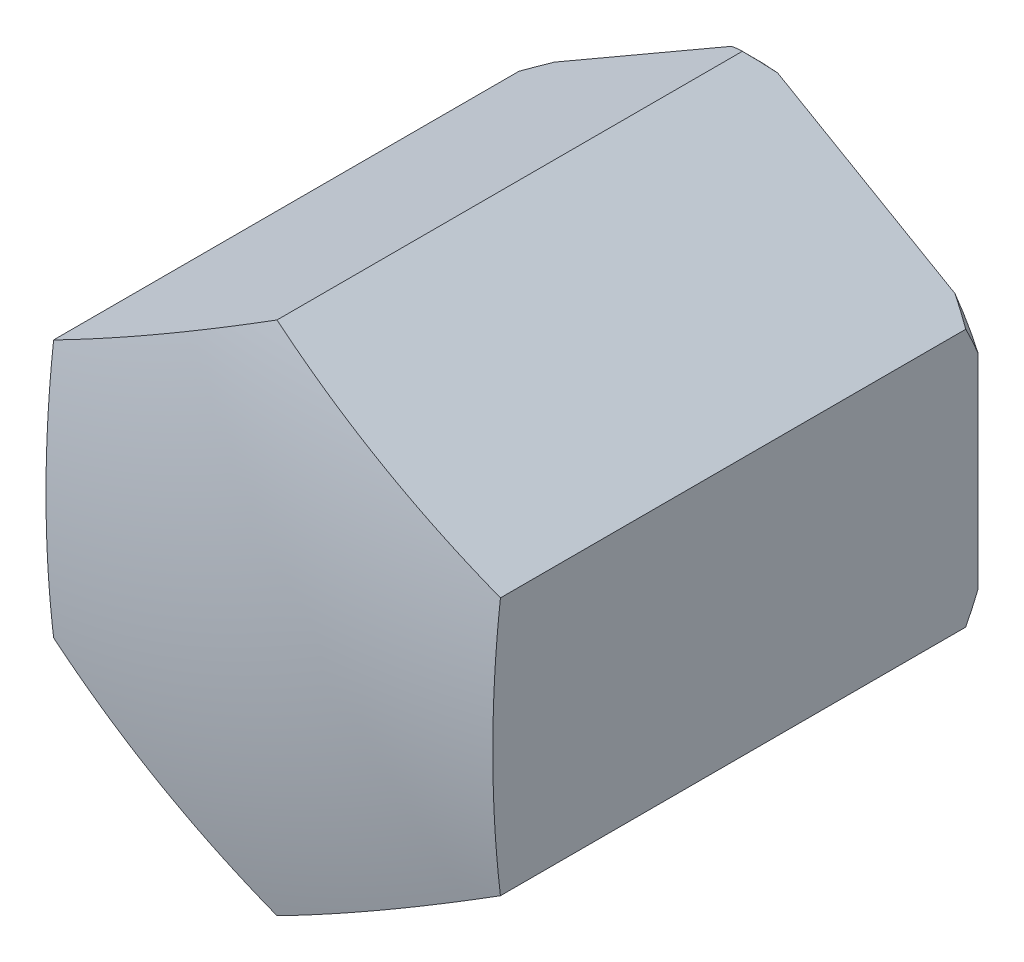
ISO-10303-21;
HEADER;
FILE_DESCRIPTION(('STEP AP214'),'2;1');
FILE_NAME('part.step','',(''),(''),'','','');
FILE_SCHEMA(('AUTOMOTIVE_DESIGN { 1 0 10303 214 1 1 1 1 }'));
ENDSEC;
DATA;
#1=APPLICATION_CONTEXT('core data for automotive mechanical design processes');
#2=APPLICATION_PROTOCOL_DEFINITION('international standard','automotive_design',2000,#1);
#3=PRODUCT_CONTEXT('',#1,'mechanical');
#4=PRODUCT('Part','Part','',(#3));
#5=PRODUCT_RELATED_PRODUCT_CATEGORY('part','',(#4));
#6=PRODUCT_DEFINITION_FORMATION('','',#4);
#7=PRODUCT_DEFINITION_CONTEXT('part definition',#1,'design');
#8=PRODUCT_DEFINITION('design','',#6,#7);
#9=PRODUCT_DEFINITION_SHAPE('','',#8);
#10=(LENGTH_UNIT() NAMED_UNIT(*) SI_UNIT(.MILLI.,.METRE.));
#11=(NAMED_UNIT(*) PLANE_ANGLE_UNIT() SI_UNIT($,.RADIAN.));
#12=(NAMED_UNIT(*) SI_UNIT($,.STERADIAN.) SOLID_ANGLE_UNIT());
#13=UNCERTAINTY_MEASURE_WITH_UNIT(LENGTH_MEASURE(1.E-05),#10,'distance_accuracy_value','');
#14=(GEOMETRIC_REPRESENTATION_CONTEXT(3) GLOBAL_UNCERTAINTY_ASSIGNED_CONTEXT((#13)) GLOBAL_UNIT_ASSIGNED_CONTEXT((#10,
#11,#12)) REPRESENTATION_CONTEXT('',''));
#15=CARTESIAN_POINT('',(0.,0.,0.));
#16=DIRECTION('',(0.,0.,1.));
#17=DIRECTION('',(1.,0.,0.));
#18=AXIS2_PLACEMENT_3D('',#15,#16,#17);
#19=CARTESIAN_POINT('',(0.,12.701705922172,26.));
#20=DIRECTION('',(0.500000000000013,-0.866025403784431,0.));
#21=DIRECTION('',(0.866025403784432,0.500000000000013,0.));
#22=AXIS2_PLACEMENT_3D('',#19,#20,#21);
#23=PLANE('',#22);
#24=CARTESIAN_POINT('',(-5.5000000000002,9.52627944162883,-30.));
#25=DIRECTION('',(0.500000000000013,-0.866025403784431,0.));
#26=DIRECTION('',(0.866025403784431,0.500000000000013,0.));
#27=AXIS2_PLACEMENT_3D('',#24,#25,#26);
#28=CIRCLE('',#27,53.8887743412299);
#29=CARTESIAN_POINT('',(0.,12.701705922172,23.5132382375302));
#30=VERTEX_POINT('',#29);
#31=CARTESIAN_POINT('',(-11.,6.3508529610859,23.5132382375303));
#32=VERTEX_POINT('',#31);
#33=EDGE_CURVE('E105',#30,#32,#28,.T.);
#34=ORIENTED_EDGE('',*,*,#33,.F.);
#35=DIRECTION('',(0.,0.,-1.));
#36=VECTOR('',#35,1.);
#37=CARTESIAN_POINT('',(0.,12.701705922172,26.));
#38=LINE('',#37,#36);
#39=CARTESIAN_POINT('',(0.,12.701705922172,0.601705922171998));
#40=VERTEX_POINT('',#39);
#41=EDGE_CURVE('E111',#30,#40,#38,.T.);
#42=ORIENTED_EDGE('',*,*,#41,.T.);
#43=CARTESIAN_POINT('',(0.000200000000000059,12.7018213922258,0.601821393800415));
#44=CARTESIAN_POINT('',(-0.0929349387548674,12.6480499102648,0.548049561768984));
#45=CARTESIAN_POINT('',(-0.186425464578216,12.594073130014,0.495094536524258));
#46=CARTESIAN_POINT('',(-0.374109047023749,12.4857139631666,0.390955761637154));
#47=CARTESIAN_POINT('',(-0.468301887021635,12.431331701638,0.339771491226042));
#48=CARTESIAN_POINT('',(-0.6574388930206,12.3221334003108,0.239278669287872));
#49=CARTESIAN_POINT('',(-0.752383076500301,12.2673173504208,0.189970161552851));
#50=CARTESIAN_POINT('',(-0.943063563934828,12.1572279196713,0.0933496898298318));
#51=CARTESIAN_POINT('',(-1.0388000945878,12.1019544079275,0.0460383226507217));
#52=CARTESIAN_POINT('',(-1.13492611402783,12.0464560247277,-0.000199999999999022));
#53=B_SPLINE_CURVE_WITH_KNOTS('',3,(#43,#44,#45,#46,#47,#48,#49,#50,#51,#52),.UNSPECIFIED.,.F.,
.F.,(4,2,2,2,4),(0.,0.360709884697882,0.721312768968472,1.08192406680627,1.44264237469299),.UNSPECIFIED.);
#54=CARTESIAN_POINT('',(-1.13451033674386,12.0466960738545,0.));
#55=VERTEX_POINT('',#54);
#56=EDGE_CURVE('E217',#40,#55,#53,.T.);
#57=ORIENTED_EDGE('',*,*,#56,.T.);
#58=DIRECTION('',(-0.866025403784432,-0.500000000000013,0.));
#59=VECTOR('',#58,1.);
#60=CARTESIAN_POINT('',(3.57499999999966,14.7657331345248,0.));
#61=LINE('',#60,#59);
#62=CARTESIAN_POINT('',(-9.86548966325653,7.00586280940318,0.));
#63=VERTEX_POINT('',#62);
#64=EDGE_CURVE('E23',#55,#63,#61,.T.);
#65=ORIENTED_EDGE('',*,*,#64,.T.);
#66=CARTESIAN_POINT('',(-9.86507388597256,7.00610285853,-0.00019999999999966));
#67=CARTESIAN_POINT('',(-9.96119990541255,6.95060447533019,0.0460383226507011));
#68=CARTESIAN_POINT('',(-10.0569364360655,6.89533096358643,0.0933496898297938));
#69=CARTESIAN_POINT('',(-10.2476169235,6.78524153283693,0.189970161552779));
#70=CARTESIAN_POINT('',(-10.3425611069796,6.73042548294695,0.239278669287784));
#71=CARTESIAN_POINT('',(-10.5316981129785,6.62122718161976,0.339771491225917));
#72=CARTESIAN_POINT('',(-10.6258909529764,6.56684492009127,0.390955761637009));
#73=CARTESIAN_POINT('',(-10.8135745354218,6.4584857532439,0.495094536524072));
#74=CARTESIAN_POINT('',(-10.9070650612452,6.40450897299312,0.548049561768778));
#75=CARTESIAN_POINT('',(-11.0002,6.35073749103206,0.601821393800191));
#76=B_SPLINE_CURVE_WITH_KNOTS('',3,(#66,#67,#68,#69,#70,#71,#72,#73,#74,#75),.UNSPECIFIED.,.F.,
.F.,(4,2,2,2,4),(0.,0.360718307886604,0.721329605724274,1.08193248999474,1.4426423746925),.UNSPECIFIED.);
#77=CARTESIAN_POINT('',(-11.,6.3508529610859,0.601705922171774));
#78=VERTEX_POINT('',#77);
#79=EDGE_CURVE('E223',#63,#78,#76,.T.);
#80=ORIENTED_EDGE('',*,*,#79,.T.);
#81=DIRECTION('',(0.,0.,-1.));
#82=VECTOR('',#81,1.);
#83=CARTESIAN_POINT('',(-11.,6.3508529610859,26.));
#84=LINE('',#83,#82);
#85=EDGE_CURVE('E114',#32,#78,#84,.T.);
#86=ORIENTED_EDGE('',*,*,#85,.F.);
#87=EDGE_LOOP('',(#34,#42,#57,#65,#80,#86));
#88=FACE_BOUND('',#87,.T.);
#89=ADVANCED_FACE('F14',(#88),#23,.F.);
#90=CARTESIAN_POINT('',(-11.,6.3508529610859,26.));
#91=DIRECTION('',(1.,0.,0.));
#92=DIRECTION('',(0.,1.,0.));
#93=AXIS2_PLACEMENT_3D('',#90,#91,#92);
#94=PLANE('',#93);
#95=CARTESIAN_POINT('',(-11.,0.,-30.));
#96=DIRECTION('',(1.,0.,0.));
#97=DIRECTION('',(0.,0.,-1.));
#98=AXIS2_PLACEMENT_3D('',#95,#96,#97);
#99=CIRCLE('',#98,53.8887743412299);
#100=CARTESIAN_POINT('',(-11.,-6.3508529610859,23.5132382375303));
#101=VERTEX_POINT('',#100);
#102=EDGE_CURVE('E116',#32,#101,#99,.T.);
#103=ORIENTED_EDGE('',*,*,#102,.F.);
#104=ORIENTED_EDGE('',*,*,#85,.T.);
#105=CARTESIAN_POINT('',(-11.,16.0724477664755,7.37623108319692));
#106=CARTESIAN_POINT('',(-11.,15.8702057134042,7.2093371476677));
#107=CARTESIAN_POINT('',(-11.,15.6674737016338,7.04303709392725));
#108=CARTESIAN_POINT('',(-11.,15.2609313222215,6.71175492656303));
#109=CARTESIAN_POINT('',(-11.,15.0571209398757,6.54677283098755));
#110=CARTESIAN_POINT('',(-11.,14.4438351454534,6.05392702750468));
#111=CARTESIAN_POINT('',(-11.,14.0326017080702,5.72824373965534));
#112=CARTESIAN_POINT('',(-11.,13.1999564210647,5.08050106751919));
#113=CARTESIAN_POINT('',(-11.,12.7784823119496,4.75852150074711));
#114=CARTESIAN_POINT('',(-11.,11.9286566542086,4.12384110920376));
#115=CARTESIAN_POINT('',(-11.,11.5003057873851,3.81113937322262));
#116=CARTESIAN_POINT('',(-11.,10.5931500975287,3.16769731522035));
#117=CARTESIAN_POINT('',(-11.,10.1134868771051,2.83815635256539));
#118=CARTESIAN_POINT('',(-11.,9.38449294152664,2.35805816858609));
#119=CARTESIAN_POINT('',(-11.,9.13985858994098,2.20036220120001));
#120=CARTESIAN_POINT('',(-11.,8.64708986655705,1.89054685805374));
#121=CARTESIAN_POINT('',(-11.,8.39895566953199,1.73842720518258));
#122=CARTESIAN_POINT('',(-11.,7.89995903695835,1.441394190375));
#123=CARTESIAN_POINT('',(-11.,7.64911460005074,1.29645066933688));
#124=CARTESIAN_POINT('',(-11.,7.14316420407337,1.01414178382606));
#125=CARTESIAN_POINT('',(-11.,6.8880580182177,0.876776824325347));
#126=CARTESIAN_POINT('',(-11.,6.37340355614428,0.611087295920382));
#127=CARTESIAN_POINT('',(-11.,6.11385871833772,0.482756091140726));
#128=CARTESIAN_POINT('',(-11.,5.58983912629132,0.236644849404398));
#129=CARTESIAN_POINT('',(-11.,5.32536528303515,0.118862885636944));
#130=CARTESIAN_POINT('',(-11.,4.87055760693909,-0.0711489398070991));
#131=CARTESIAN_POINT('',(-11.,4.68153595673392,-0.146517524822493));
#132=CARTESIAN_POINT('',(-11.,4.30090682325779,-0.290396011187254));
#133=CARTESIAN_POINT('',(-11.,4.10929935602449,-0.35890595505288));
#134=CARTESIAN_POINT('',(-11.,3.53054922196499,-0.55302199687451));
#135=CARTESIAN_POINT('',(-11.,3.13947003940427,-0.667218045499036));
#136=CARTESIAN_POINT('',(-11.,2.3571577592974,-0.856520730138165));
#137=CARTESIAN_POINT('',(-11.,1.96613010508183,-0.932456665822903));
#138=CARTESIAN_POINT('',(-11.,1.3754168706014,-1.01606525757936));
#139=CARTESIAN_POINT('',(-11.,1.17780635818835,-1.03888598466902));
#140=CARTESIAN_POINT('',(-11.,0.781637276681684,-1.0740268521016));
#141=CARTESIAN_POINT('',(-11.,0.583078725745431,-1.0863471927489));
#142=CARTESIAN_POINT('',(-11.,0.196510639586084,-1.09984708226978));
#143=CARTESIAN_POINT('',(-11.,0.00852086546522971,-1.10160151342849));
#144=CARTESIAN_POINT('',(-11.,-0.367323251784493,-1.09547279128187));
#145=CARTESIAN_POINT('',(-11.,-0.555177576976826,-1.08758853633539));
#146=CARTESIAN_POINT('',(-11.,-0.930229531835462,-1.06232225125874));
#147=CARTESIAN_POINT('',(-11.,-1.11742721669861,-1.04494103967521));
#148=CARTESIAN_POINT('',(-11.,-1.49075054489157,-1.00099406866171));
#149=CARTESIAN_POINT('',(-11.,-1.67687603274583,-0.974427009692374));
#150=CARTESIAN_POINT('',(-11.,-2.24018324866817,-0.880381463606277));
#151=CARTESIAN_POINT('',(-11.,-2.61511811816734,-0.799063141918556));
#152=CARTESIAN_POINT('',(-11.,-3.35650285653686,-0.604878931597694));
#153=CARTESIAN_POINT('',(-11.,-3.72295280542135,-0.492013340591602));
#154=CARTESIAN_POINT('',(-11.,-4.4529629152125,-0.237887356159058));
#155=CARTESIAN_POINT('',(-11.,-4.81636046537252,-0.0961649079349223));
#156=CARTESIAN_POINT('',(-11.,-5.53386860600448,0.20927334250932));
#157=CARTESIAN_POINT('',(-11.,-5.88797506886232,0.372998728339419));
#158=CARTESIAN_POINT('',(-11.,-6.5885282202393,0.718563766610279));
#159=CARTESIAN_POINT('',(-11.,-6.93494780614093,0.900457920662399));
#160=CARTESIAN_POINT('',(-11.,-7.61987412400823,1.27837528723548));
#161=CARTESIAN_POINT('',(-11.,-7.95838202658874,1.47439639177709));
#162=CARTESIAN_POINT('',(-11.,-8.61194162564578,1.86785203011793));
#163=CARTESIAN_POINT('',(-11.,-8.92732558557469,2.06473756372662));
#164=CARTESIAN_POINT('',(-11.,-9.55267412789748,2.46695903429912));
#165=CARTESIAN_POINT('',(-11.,-9.86263830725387,2.67229559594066));
#166=CARTESIAN_POINT('',(-11.,-10.4753887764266,3.08826754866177));
#167=CARTESIAN_POINT('',(-11.,-10.7782124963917,3.29884800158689));
#168=CARTESIAN_POINT('',(-11.,-11.3796956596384,3.72570793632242));
#169=CARTESIAN_POINT('',(-11.,-11.6783562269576,3.94198583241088));
#170=CARTESIAN_POINT('',(-11.,-11.9752680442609,4.16059792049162));
#171=B_SPLINE_CURVE_WITH_KNOTS('',3,(#105,#106,#107,#108,#109,#110,#111,#112,#113,#114,#115,
#116,#117,#118,#119,#120,#121,#122,#123,#124,#125,#126,#127,#128,#129,#130,#131,#132,#133,#134,
#135,#136,#137,#138,#139,#140,#141,#142,#143,#144,#145,#146,#147,#148,#149,#150,#151,#152,#153,
#154,#155,#156,#157,#158,#159,#160,#161,#162,#163,#164,#165,#166,#167,#168,#169,#170),
.UNSPECIFIED.,.F.,.F.,(4,2,2,2,2,2,2,2,2,2,2,2,2,2,2,2,2,2,2,2,2,2,2,2,2,2,2,2,2,2,2,2,4),(0.,
0.7866358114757,1.57328237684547,3.14695168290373,4.73801099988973,6.32891353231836,
8.0743905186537,8.94750152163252,9.82056907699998,10.6895860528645,11.5586494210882,
12.4270675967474,13.2953268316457,13.9056838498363,14.5160370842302,15.7367149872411,
16.9296541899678,17.5261883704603,18.1227111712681,18.6864613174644,19.2502759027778,
19.8140419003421,20.3778876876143,21.5270730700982,22.6762476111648,23.845519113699,
25.0153015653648,26.1887049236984,27.3619335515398,28.4771587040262,29.5924664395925,
30.698929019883,31.8050868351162),.UNSPECIFIED.);
#172=CARTESIAN_POINT('',(-11.,5.04083326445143,0.));
#173=VERTEX_POINT('',#172);
#174=EDGE_CURVE('E216',#78,#173,#171,.T.);
#175=ORIENTED_EDGE('',*,*,#174,.T.);
#176=DIRECTION('',(0.,-1.,0.));
#177=VECTOR('',#176,1.);
#178=CARTESIAN_POINT('',(-11.,0.,0.));
#179=LINE('',#178,#177);
#180=CARTESIAN_POINT('',(-11.,-5.04083326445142,0.));
#181=VERTEX_POINT('',#180);
#182=EDGE_CURVE('E242',#173,#181,#179,.T.);
#183=ORIENTED_EDGE('',*,*,#182,.T.);
#184=CARTESIAN_POINT('',(-11.,-6.3508529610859,0.601705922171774));
#185=VERTEX_POINT('',#184);
#186=EDGE_CURVE('E209',#181,#185,#171,.T.);
#187=ORIENTED_EDGE('',*,*,#186,.T.);
#188=DIRECTION('',(0.,0.,-1.));
#189=VECTOR('',#188,1.);
#190=CARTESIAN_POINT('',(-11.,-6.3508529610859,26.));
#191=LINE('',#190,#189);
#192=EDGE_CURVE('E134',#101,#185,#191,.T.);
#193=ORIENTED_EDGE('',*,*,#192,.F.);
#194=EDGE_LOOP('',(#103,#104,#175,#183,#187,#193));
#195=FACE_BOUND('',#194,.T.);
#196=ADVANCED_FACE('F201',(#195),#94,.F.);
#197=CARTESIAN_POINT('',(-11.,-6.3508529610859,26.));
#198=DIRECTION('',(0.500000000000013,0.866025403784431,0.));
#199=DIRECTION('',(-0.866025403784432,0.500000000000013,0.));
#200=AXIS2_PLACEMENT_3D('',#197,#198,#199);
#201=PLANE('',#200);
#202=CARTESIAN_POINT('',(-5.5000000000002,-9.52627944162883,-30.));
#203=DIRECTION('',(0.500000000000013,0.866025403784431,0.));
#204=DIRECTION('',(-0.866025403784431,0.500000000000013,0.));
#205=AXIS2_PLACEMENT_3D('',#202,#203,#204);
#206=CIRCLE('',#205,53.8887743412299);
#207=CARTESIAN_POINT('',(0.,-12.701705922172,23.5132382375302));
#208=VERTEX_POINT('',#207);
#209=EDGE_CURVE('E289',#101,#208,#206,.T.);
#210=ORIENTED_EDGE('',*,*,#209,.F.);
#211=ORIENTED_EDGE('',*,*,#192,.T.);
#212=CARTESIAN_POINT('',(-11.0002,-6.35073749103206,0.601821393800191));
#213=CARTESIAN_POINT('',(-10.9070650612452,-6.40450897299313,0.548049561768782));
#214=CARTESIAN_POINT('',(-10.8135745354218,-6.4584857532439,0.495094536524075));
#215=CARTESIAN_POINT('',(-10.6258909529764,-6.56684492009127,0.390955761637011));
#216=CARTESIAN_POINT('',(-10.5316981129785,-6.62122718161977,0.339771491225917));
#217=CARTESIAN_POINT('',(-10.3425611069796,-6.73042548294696,0.239278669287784));
#218=CARTESIAN_POINT('',(-10.2476169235,-6.78524153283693,0.189970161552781));
#219=CARTESIAN_POINT('',(-10.0569364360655,-6.89533096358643,0.0933496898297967));
#220=CARTESIAN_POINT('',(-9.96119990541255,-6.95060447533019,0.0460383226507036));
#221=CARTESIAN_POINT('',(-9.86507388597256,-7.00610285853,-0.000200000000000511));
#222=B_SPLINE_CURVE_WITH_KNOTS('',3,(#212,#213,#214,#215,#216,#217,#218,#219,#220,#221),
.UNSPECIFIED.,.F.,.F.,(4,2,2,2,4),(0.,0.360709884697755,0.721312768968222,1.08192406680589,
1.4426423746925),.UNSPECIFIED.);
#223=CARTESIAN_POINT('',(-9.86548966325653,-7.00586280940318,0.));
#224=VERTEX_POINT('',#223);
#225=EDGE_CURVE('E185',#185,#224,#222,.T.);
#226=ORIENTED_EDGE('',*,*,#225,.T.);
#227=DIRECTION('',(0.866025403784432,-0.500000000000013,0.));
#228=VECTOR('',#227,1.);
#229=CARTESIAN_POINT('',(3.57499999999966,-14.7657331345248,0.));
#230=LINE('',#229,#228);
#231=CARTESIAN_POINT('',(-1.13451033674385,-12.0466960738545,0.));
#232=VERTEX_POINT('',#231);
#233=EDGE_CURVE('E240',#224,#232,#230,.T.);
#234=ORIENTED_EDGE('',*,*,#233,.T.);
#235=CARTESIAN_POINT('',(-1.13492611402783,-12.0464560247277,-0.00019999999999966));
#236=CARTESIAN_POINT('',(-1.0388000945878,-12.1019544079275,0.0460383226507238));
#237=CARTESIAN_POINT('',(-0.94306356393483,-12.1572279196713,0.0933496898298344));
#238=CARTESIAN_POINT('',(-0.752383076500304,-12.2673173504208,0.189970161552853));
#239=CARTESIAN_POINT('',(-0.657438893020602,-12.3221334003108,0.239278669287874));
#240=CARTESIAN_POINT('',(-0.468301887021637,-12.431331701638,0.339771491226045));
#241=CARTESIAN_POINT('',(-0.374109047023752,-12.4857139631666,0.390955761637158));
#242=CARTESIAN_POINT('',(-0.186425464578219,-12.594073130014,0.495094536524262));
#243=CARTESIAN_POINT('',(-0.0929349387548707,-12.6480499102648,0.548049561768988));
#244=CARTESIAN_POINT('',(0.000199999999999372,-12.7018213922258,0.601821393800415));
#245=B_SPLINE_CURVE_WITH_KNOTS('',3,(#235,#236,#237,#238,#239,#240,#241,#242,#243,#244),
.UNSPECIFIED.,.F.,.F.,(4,2,2,2,4),(0.,0.360718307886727,0.721329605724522,1.08193248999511,
1.44264237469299),.UNSPECIFIED.);
#246=CARTESIAN_POINT('',(0.,-12.701705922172,0.601705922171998));
#247=VERTEX_POINT('',#246);
#248=EDGE_CURVE('E191',#232,#247,#245,.T.);
#249=ORIENTED_EDGE('',*,*,#248,.T.);
#250=DIRECTION('',(0.,0.,-1.));
#251=VECTOR('',#250,1.);
#252=CARTESIAN_POINT('',(0.,-12.701705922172,26.));
#253=LINE('',#252,#251);
#254=EDGE_CURVE('E132',#208,#247,#253,.T.);
#255=ORIENTED_EDGE('',*,*,#254,.F.);
#256=EDGE_LOOP('',(#210,#211,#226,#234,#249,#255));
#257=FACE_BOUND('',#256,.T.);
#258=ADVANCED_FACE('F197',(#257),#201,.F.);
#259=CARTESIAN_POINT('',(0.,-12.701705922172,26.));
#260=DIRECTION('',(-0.500000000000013,0.866025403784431,0.));
#261=DIRECTION('',(-0.866025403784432,-0.500000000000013,0.));
#262=AXIS2_PLACEMENT_3D('',#259,#260,#261);
#263=PLANE('',#262);
#264=CARTESIAN_POINT('',(5.5000000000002,-9.52627944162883,-30.));
#265=DIRECTION('',(-0.500000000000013,0.866025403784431,0.));
#266=DIRECTION('',(-0.866025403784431,-0.500000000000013,0.));
#267=AXIS2_PLACEMENT_3D('',#264,#265,#266);
#268=CIRCLE('',#267,53.8887743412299);
#269=CARTESIAN_POINT('',(11.,-6.3508529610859,23.5132382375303));
#270=VERTEX_POINT('',#269);
#271=EDGE_CURVE('E291',#208,#270,#268,.T.);
#272=ORIENTED_EDGE('',*,*,#271,.F.);
#273=ORIENTED_EDGE('',*,*,#254,.T.);
#274=CARTESIAN_POINT('',(-0.000200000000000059,-12.7018213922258,0.601821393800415));
#275=CARTESIAN_POINT('',(0.0929349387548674,-12.6480499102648,0.548049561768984));
#276=CARTESIAN_POINT('',(0.186425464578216,-12.594073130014,0.495094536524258));
#277=CARTESIAN_POINT('',(0.374109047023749,-12.4857139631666,0.390955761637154));
#278=CARTESIAN_POINT('',(0.468301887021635,-12.431331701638,0.339771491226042));
#279=CARTESIAN_POINT('',(0.6574388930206,-12.3221334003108,0.239278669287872));
#280=CARTESIAN_POINT('',(0.752383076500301,-12.2673173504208,0.189970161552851));
#281=CARTESIAN_POINT('',(0.943063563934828,-12.1572279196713,0.0933496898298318));
#282=CARTESIAN_POINT('',(1.0388000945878,-12.1019544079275,0.0460383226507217));
#283=CARTESIAN_POINT('',(1.13492611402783,-12.0464560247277,-0.000199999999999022));
#284=B_SPLINE_CURVE_WITH_KNOTS('',3,(#274,#275,#276,#277,#278,#279,#280,#281,#282,#283),
.UNSPECIFIED.,.F.,.F.,(4,2,2,2,4),(0.,0.360709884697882,0.721312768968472,1.08192406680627,
1.44264237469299),.UNSPECIFIED.);
#285=CARTESIAN_POINT('',(1.13451033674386,-12.0466960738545,0.));
#286=VERTEX_POINT('',#285);
#287=EDGE_CURVE('E172',#247,#286,#284,.T.);
#288=ORIENTED_EDGE('',*,*,#287,.T.);
#289=DIRECTION('',(0.866025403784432,0.500000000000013,0.));
#290=VECTOR('',#289,1.);
#291=CARTESIAN_POINT('',(14.575,-4.28682574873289,0.));
#292=LINE('',#291,#290);
#293=CARTESIAN_POINT('',(9.86548966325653,-7.00586280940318,0.));
#294=VERTEX_POINT('',#293);
#295=EDGE_CURVE('E238',#286,#294,#292,.T.);
#296=ORIENTED_EDGE('',*,*,#295,.T.);
#297=CARTESIAN_POINT('',(9.86507388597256,-7.00610285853,-0.00019999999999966));
#298=CARTESIAN_POINT('',(9.96119990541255,-6.95060447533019,0.0460383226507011));
#299=CARTESIAN_POINT('',(10.0569364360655,-6.89533096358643,0.0933496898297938));
#300=CARTESIAN_POINT('',(10.2476169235,-6.78524153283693,0.189970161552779));
#301=CARTESIAN_POINT('',(10.3425611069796,-6.73042548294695,0.239278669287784));
#302=CARTESIAN_POINT('',(10.5316981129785,-6.62122718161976,0.339771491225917));
#303=CARTESIAN_POINT('',(10.6258909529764,-6.56684492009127,0.390955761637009));
#304=CARTESIAN_POINT('',(10.8135745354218,-6.4584857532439,0.495094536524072));
#305=CARTESIAN_POINT('',(10.9070650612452,-6.40450897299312,0.548049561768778));
#306=CARTESIAN_POINT('',(11.0002,-6.35073749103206,0.601821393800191));
#307=B_SPLINE_CURVE_WITH_KNOTS('',3,(#297,#298,#299,#300,#301,#302,#303,#304,#305,#306),
.UNSPECIFIED.,.F.,.F.,(4,2,2,2,4),(0.,0.360718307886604,0.721329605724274,1.08193248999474,
1.4426423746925),.UNSPECIFIED.);
#308=CARTESIAN_POINT('',(11.,-6.3508529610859,0.601705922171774));
#309=VERTEX_POINT('',#308);
#310=EDGE_CURVE('E178',#294,#309,#307,.T.);
#311=ORIENTED_EDGE('',*,*,#310,.T.);
#312=DIRECTION('',(0.,0.,-1.));
#313=VECTOR('',#312,1.);
#314=CARTESIAN_POINT('',(11.,-6.3508529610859,26.));
#315=LINE('',#314,#313);
#316=EDGE_CURVE('E125',#270,#309,#315,.T.);
#317=ORIENTED_EDGE('',*,*,#316,.F.);
#318=EDGE_LOOP('',(#272,#273,#288,#296,#311,#317));
#319=FACE_BOUND('',#318,.T.);
#320=ADVANCED_FACE('F160',(#319),#263,.F.);
#321=CARTESIAN_POINT('',(11.,-6.3508529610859,26.));
#322=DIRECTION('',(-1.,0.,0.));
#323=DIRECTION('',(0.,-1.,0.));
#324=AXIS2_PLACEMENT_3D('',#321,#322,#323);
#325=PLANE('',#324);
#326=CARTESIAN_POINT('',(11.,0.,-30.));
#327=DIRECTION('',(-1.,0.,0.));
#328=DIRECTION('',(0.,0.,1.));
#329=AXIS2_PLACEMENT_3D('',#326,#327,#328);
#330=CIRCLE('',#329,53.8887743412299);
#331=CARTESIAN_POINT('',(11.,6.3508529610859,23.5132382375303));
#332=VERTEX_POINT('',#331);
#333=EDGE_CURVE('E29',#270,#332,#330,.T.);
#334=ORIENTED_EDGE('',*,*,#333,.F.);
#335=ORIENTED_EDGE('',*,*,#316,.T.);
#336=CARTESIAN_POINT('',(11.,16.0724477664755,7.37623108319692));
#337=CARTESIAN_POINT('',(11.,15.8702057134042,7.2093371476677));
#338=CARTESIAN_POINT('',(11.,15.6674737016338,7.04303709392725));
#339=CARTESIAN_POINT('',(11.,15.2609313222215,6.71175492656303));
#340=CARTESIAN_POINT('',(11.,15.0571209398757,6.54677283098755));
#341=CARTESIAN_POINT('',(11.,14.4438351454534,6.05392702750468));
#342=CARTESIAN_POINT('',(11.,14.0326017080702,5.72824373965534));
#343=CARTESIAN_POINT('',(11.,13.1999564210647,5.08050106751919));
#344=CARTESIAN_POINT('',(11.,12.7784823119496,4.75852150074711));
#345=CARTESIAN_POINT('',(11.,11.9286566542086,4.12384110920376));
#346=CARTESIAN_POINT('',(11.,11.5003057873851,3.81113937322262));
#347=CARTESIAN_POINT('',(11.,10.5931500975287,3.16769731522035));
#348=CARTESIAN_POINT('',(11.,10.1134868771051,2.83815635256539));
#349=CARTESIAN_POINT('',(11.,9.38449294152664,2.35805816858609));
#350=CARTESIAN_POINT('',(11.,9.13985858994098,2.20036220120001));
#351=CARTESIAN_POINT('',(11.,8.64708986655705,1.89054685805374));
#352=CARTESIAN_POINT('',(11.,8.39895566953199,1.73842720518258));
#353=CARTESIAN_POINT('',(11.,7.89995903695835,1.441394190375));
#354=CARTESIAN_POINT('',(11.,7.64911460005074,1.29645066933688));
#355=CARTESIAN_POINT('',(11.,7.14316420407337,1.01414178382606));
#356=CARTESIAN_POINT('',(11.,6.8880580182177,0.876776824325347));
#357=CARTESIAN_POINT('',(11.,6.37340355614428,0.611087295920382));
#358=CARTESIAN_POINT('',(11.,6.11385871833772,0.482756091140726));
#359=CARTESIAN_POINT('',(11.,5.58983912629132,0.236644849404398));
#360=CARTESIAN_POINT('',(11.,5.32536528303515,0.118862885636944));
#361=CARTESIAN_POINT('',(11.,4.87055760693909,-0.0711489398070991));
#362=CARTESIAN_POINT('',(11.,4.68153595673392,-0.146517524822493));
#363=CARTESIAN_POINT('',(11.,4.30090682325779,-0.290396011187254));
#364=CARTESIAN_POINT('',(11.,4.10929935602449,-0.35890595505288));
#365=CARTESIAN_POINT('',(11.,3.53054922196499,-0.55302199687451));
#366=CARTESIAN_POINT('',(11.,3.13947003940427,-0.667218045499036));
#367=CARTESIAN_POINT('',(11.,2.3571577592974,-0.856520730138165));
#368=CARTESIAN_POINT('',(11.,1.96613010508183,-0.932456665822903));
#369=CARTESIAN_POINT('',(11.,1.3754168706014,-1.01606525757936));
#370=CARTESIAN_POINT('',(11.,1.17780635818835,-1.03888598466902));
#371=CARTESIAN_POINT('',(11.,0.781637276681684,-1.0740268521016));
#372=CARTESIAN_POINT('',(11.,0.583078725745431,-1.0863471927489));
#373=CARTESIAN_POINT('',(11.,0.196510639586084,-1.09984708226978));
#374=CARTESIAN_POINT('',(11.,0.00852086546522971,-1.10160151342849));
#375=CARTESIAN_POINT('',(11.,-0.367323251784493,-1.09547279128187));
#376=CARTESIAN_POINT('',(11.,-0.555177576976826,-1.08758853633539));
#377=CARTESIAN_POINT('',(11.,-0.930229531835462,-1.06232225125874));
#378=CARTESIAN_POINT('',(11.,-1.11742721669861,-1.04494103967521));
#379=CARTESIAN_POINT('',(11.,-1.49075054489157,-1.00099406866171));
#380=CARTESIAN_POINT('',(11.,-1.67687603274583,-0.974427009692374));
#381=CARTESIAN_POINT('',(11.,-2.24018324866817,-0.880381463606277));
#382=CARTESIAN_POINT('',(11.,-2.61511811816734,-0.799063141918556));
#383=CARTESIAN_POINT('',(11.,-3.35650285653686,-0.604878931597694));
#384=CARTESIAN_POINT('',(11.,-3.72295280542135,-0.492013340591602));
#385=CARTESIAN_POINT('',(11.,-4.4529629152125,-0.237887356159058));
#386=CARTESIAN_POINT('',(11.,-4.81636046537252,-0.0961649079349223));
#387=CARTESIAN_POINT('',(11.,-5.53386860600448,0.20927334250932));
#388=CARTESIAN_POINT('',(11.,-5.88797506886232,0.372998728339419));
#389=CARTESIAN_POINT('',(11.,-6.5885282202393,0.718563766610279));
#390=CARTESIAN_POINT('',(11.,-6.93494780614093,0.900457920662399));
#391=CARTESIAN_POINT('',(11.,-7.61987412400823,1.27837528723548));
#392=CARTESIAN_POINT('',(11.,-7.95838202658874,1.47439639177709));
#393=CARTESIAN_POINT('',(11.,-8.61194162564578,1.86785203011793));
#394=CARTESIAN_POINT('',(11.,-8.92732558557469,2.06473756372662));
#395=CARTESIAN_POINT('',(11.,-9.55267412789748,2.46695903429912));
#396=CARTESIAN_POINT('',(11.,-9.86263830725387,2.67229559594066));
#397=CARTESIAN_POINT('',(11.,-10.4753887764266,3.08826754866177));
#398=CARTESIAN_POINT('',(11.,-10.7782124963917,3.29884800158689));
#399=CARTESIAN_POINT('',(11.,-11.3796956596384,3.72570793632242));
#400=CARTESIAN_POINT('',(11.,-11.6783562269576,3.94198583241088));
#401=CARTESIAN_POINT('',(11.,-11.9752680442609,4.16059792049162));
#402=B_SPLINE_CURVE_WITH_KNOTS('',3,(#336,#337,#338,#339,#340,#341,#342,#343,#344,#345,#346,
#347,#348,#349,#350,#351,#352,#353,#354,#355,#356,#357,#358,#359,#360,#361,#362,#363,#364,#365,
#366,#367,#368,#369,#370,#371,#372,#373,#374,#375,#376,#377,#378,#379,#380,#381,#382,#383,#384,
#385,#386,#387,#388,#389,#390,#391,#392,#393,#394,#395,#396,#397,#398,#399,#400,#401),
.UNSPECIFIED.,.F.,.F.,(4,2,2,2,2,2,2,2,2,2,2,2,2,2,2,2,2,2,2,2,2,2,2,2,2,2,2,2,2,2,2,2,4),(0.,
0.7866358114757,1.57328237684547,3.14695168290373,4.73801099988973,6.32891353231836,
8.0743905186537,8.94750152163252,9.82056907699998,10.6895860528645,11.5586494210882,
12.4270675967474,13.2953268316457,13.9056838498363,14.5160370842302,15.7367149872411,
16.9296541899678,17.5261883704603,18.1227111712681,18.6864613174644,19.2502759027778,
19.8140419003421,20.3778876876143,21.5270730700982,22.6762476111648,23.845519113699,
25.0153015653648,26.1887049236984,27.3619335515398,28.4771587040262,29.5924664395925,
30.698929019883,31.8050868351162),.UNSPECIFIED.);
#403=CARTESIAN_POINT('',(11.,-5.04083326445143,0.));
#404=VERTEX_POINT('',#403);
#405=EDGE_CURVE('E171',#309,#404,#402,.F.);
#406=ORIENTED_EDGE('',*,*,#405,.T.);
#407=DIRECTION('',(0.,1.,0.));
#408=VECTOR('',#407,1.);
#409=CARTESIAN_POINT('',(11.,0.,0.));
#410=LINE('',#409,#408);
#411=CARTESIAN_POINT('',(11.,5.04083326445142,0.));
#412=VERTEX_POINT('',#411);
#413=EDGE_CURVE('E236',#404,#412,#410,.T.);
#414=ORIENTED_EDGE('',*,*,#413,.T.);
#415=CARTESIAN_POINT('',(11.,6.3508529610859,0.601705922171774));
#416=VERTEX_POINT('',#415);
#417=EDGE_CURVE('E164',#412,#416,#402,.F.);
#418=ORIENTED_EDGE('',*,*,#417,.T.);
#419=DIRECTION('',(0.,0.,-1.));
#420=VECTOR('',#419,1.);
#421=CARTESIAN_POINT('',(11.,6.3508529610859,26.));
#422=LINE('',#421,#420);
#423=EDGE_CURVE('E122',#332,#416,#422,.T.);
#424=ORIENTED_EDGE('',*,*,#423,.F.);
#425=EDGE_LOOP('',(#334,#335,#406,#414,#418,#424));
#426=FACE_BOUND('',#425,.T.);
#427=ADVANCED_FACE('F153',(#426),#325,.F.);
#428=CARTESIAN_POINT('',(11.,6.3508529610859,26.));
#429=DIRECTION('',(-0.500000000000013,-0.866025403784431,0.));
#430=DIRECTION('',(0.866025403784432,-0.500000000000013,0.));
#431=AXIS2_PLACEMENT_3D('',#428,#429,#430);
#432=PLANE('',#431);
#433=CARTESIAN_POINT('',(5.5000000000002,9.52627944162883,-30.));
#434=DIRECTION('',(-0.500000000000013,-0.866025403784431,0.));
#435=DIRECTION('',(0.866025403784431,-0.500000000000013,0.));
#436=AXIS2_PLACEMENT_3D('',#433,#434,#435);
#437=CIRCLE('',#436,53.8887743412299);
#438=EDGE_CURVE('E9',#332,#30,#437,.T.);
#439=ORIENTED_EDGE('',*,*,#438,.F.);
#440=ORIENTED_EDGE('',*,*,#423,.T.);
#441=CARTESIAN_POINT('',(11.0002,6.35073749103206,0.601821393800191));
#442=CARTESIAN_POINT('',(10.9070650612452,6.40450897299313,0.548049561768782));
#443=CARTESIAN_POINT('',(10.8135745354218,6.4584857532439,0.495094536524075));
#444=CARTESIAN_POINT('',(10.6258909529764,6.56684492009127,0.390955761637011));
#445=CARTESIAN_POINT('',(10.5316981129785,6.62122718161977,0.339771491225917));
#446=CARTESIAN_POINT('',(10.3425611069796,6.73042548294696,0.239278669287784));
#447=CARTESIAN_POINT('',(10.2476169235,6.78524153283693,0.189970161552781));
#448=CARTESIAN_POINT('',(10.0569364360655,6.89533096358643,0.0933496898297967));
#449=CARTESIAN_POINT('',(9.96119990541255,6.95060447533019,0.0460383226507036));
#450=CARTESIAN_POINT('',(9.86507388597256,7.00610285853,-0.000200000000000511));
#451=B_SPLINE_CURVE_WITH_KNOTS('',3,(#441,#442,#443,#444,#445,#446,#447,#448,#449,#450),
.UNSPECIFIED.,.F.,.F.,(4,2,2,2,4),(0.,0.360709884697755,0.721312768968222,1.08192406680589,
1.4426423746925),.UNSPECIFIED.);
#452=CARTESIAN_POINT('',(9.86548966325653,7.00586280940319,0.));
#453=VERTEX_POINT('',#452);
#454=EDGE_CURVE('E37',#416,#453,#451,.T.);
#455=ORIENTED_EDGE('',*,*,#454,.T.);
#456=DIRECTION('',(-0.866025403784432,0.500000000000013,0.));
#457=VECTOR('',#456,1.);
#458=CARTESIAN_POINT('',(14.575,4.28682574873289,0.));
#459=LINE('',#458,#457);
#460=CARTESIAN_POINT('',(1.13451033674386,12.0466960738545,0.));
#461=VERTEX_POINT('',#460);
#462=EDGE_CURVE('E234',#453,#461,#459,.T.);
#463=ORIENTED_EDGE('',*,*,#462,.T.);
#464=CARTESIAN_POINT('',(1.13492611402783,12.0464560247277,-0.00019999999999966));
#465=CARTESIAN_POINT('',(1.0388000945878,12.1019544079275,0.0460383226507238));
#466=CARTESIAN_POINT('',(0.94306356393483,12.1572279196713,0.0933496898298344));
#467=CARTESIAN_POINT('',(0.752383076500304,12.2673173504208,0.189970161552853));
#468=CARTESIAN_POINT('',(0.657438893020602,12.3221334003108,0.239278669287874));
#469=CARTESIAN_POINT('',(0.468301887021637,12.431331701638,0.339771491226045));
#470=CARTESIAN_POINT('',(0.374109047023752,12.4857139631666,0.390955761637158));
#471=CARTESIAN_POINT('',(0.186425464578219,12.594073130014,0.495094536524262));
#472=CARTESIAN_POINT('',(0.0929349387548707,12.6480499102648,0.548049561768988));
#473=CARTESIAN_POINT('',(-0.000199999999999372,12.7018213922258,0.601821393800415));
#474=B_SPLINE_CURVE_WITH_KNOTS('',3,(#464,#465,#466,#467,#468,#469,#470,#471,#472,#473),
.UNSPECIFIED.,.F.,.F.,(4,2,2,2,4),(0.,0.360718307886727,0.721329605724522,1.08193248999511,
1.44264237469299),.UNSPECIFIED.);
#475=EDGE_CURVE('E120',#461,#40,#474,.T.);
#476=ORIENTED_EDGE('',*,*,#475,.T.);
#477=ORIENTED_EDGE('',*,*,#41,.F.);
#478=EDGE_LOOP('',(#439,#440,#455,#463,#476,#477));
#479=FACE_BOUND('',#478,.T.);
#480=ADVANCED_FACE('F118',(#479),#432,.F.);
#481=CARTESIAN_POINT('',(0.,0.,0.));
#482=DIRECTION('',(0.,0.,1.));
#483=DIRECTION('',(0.,-1.,0.));
#484=AXIS2_PLACEMENT_3D('',#481,#482,#483);
#485=CONICAL_SURFACE('',#484,12.1,0.785398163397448);
#486=ORIENTED_EDGE('',*,*,#79,.F.);
#487=CARTESIAN_POINT('',(0.,0.,0.));
#488=DIRECTION('',(0.,0.,-1.));
#489=DIRECTION('',(0.,1.,0.));
#490=AXIS2_PLACEMENT_3D('',#487,#488,#489);
#491=CIRCLE('',#490,12.1);
#492=EDGE_CURVE('E232',#173,#63,#491,.T.);
#493=ORIENTED_EDGE('',*,*,#492,.F.);
#494=ORIENTED_EDGE('',*,*,#174,.F.);
#495=EDGE_LOOP('',(#486,#493,#494));
#496=FACE_BOUND('',#495,.T.);
#497=ADVANCED_FACE('F152',(#496),#485,.T.);
#498=ORIENTED_EDGE('',*,*,#186,.F.);
#499=EDGE_CURVE('E255',#224,#181,#491,.T.);
#500=ORIENTED_EDGE('',*,*,#499,.F.);
#501=ORIENTED_EDGE('',*,*,#225,.F.);
#502=EDGE_LOOP('',(#498,#500,#501));
#503=FACE_BOUND('',#502,.T.);
#504=ADVANCED_FACE('F287',(#503),#485,.T.);
#505=ORIENTED_EDGE('',*,*,#248,.F.);
#506=EDGE_CURVE('E256',#286,#232,#491,.T.);
#507=ORIENTED_EDGE('',*,*,#506,.F.);
#508=ORIENTED_EDGE('',*,*,#287,.F.);
#509=EDGE_LOOP('',(#505,#507,#508));
#510=FACE_BOUND('',#509,.T.);
#511=ADVANCED_FACE('F280',(#510),#485,.T.);
#512=ORIENTED_EDGE('',*,*,#310,.F.);
#513=EDGE_CURVE('E260',#404,#294,#491,.T.);
#514=ORIENTED_EDGE('',*,*,#513,.F.);
#515=ORIENTED_EDGE('',*,*,#405,.F.);
#516=EDGE_LOOP('',(#512,#514,#515));
#517=FACE_BOUND('',#516,.T.);
#518=ADVANCED_FACE('F274',(#517),#485,.T.);
#519=ORIENTED_EDGE('',*,*,#56,.F.);
#520=ORIENTED_EDGE('',*,*,#475,.F.);
#521=EDGE_CURVE('E229',#55,#461,#491,.T.);
#522=ORIENTED_EDGE('',*,*,#521,.F.);
#523=EDGE_LOOP('',(#519,#520,#522));
#524=FACE_BOUND('',#523,.T.);
#525=ADVANCED_FACE('F360',(#524),#485,.T.);
#526=ORIENTED_EDGE('',*,*,#417,.F.);
#527=EDGE_CURVE('E233',#453,#412,#491,.T.);
#528=ORIENTED_EDGE('',*,*,#527,.F.);
#529=ORIENTED_EDGE('',*,*,#454,.F.);
#530=EDGE_LOOP('',(#526,#528,#529));
#531=FACE_BOUND('',#530,.T.);
#532=ADVANCED_FACE('F16',(#531),#485,.T.);
#533=CARTESIAN_POINT('',(12.1,0.,0.));
#534=DIRECTION('',(0.,0.,-1.));
#535=DIRECTION('',(0.,1.,0.));
#536=AXIS2_PLACEMENT_3D('',#533,#534,#535);
#537=PLANE('',#536);
#538=ORIENTED_EDGE('',*,*,#64,.F.);
#539=ORIENTED_EDGE('',*,*,#521,.T.);
#540=ORIENTED_EDGE('',*,*,#462,.F.);
#541=ORIENTED_EDGE('',*,*,#527,.T.);
#542=ORIENTED_EDGE('',*,*,#413,.F.);
#543=ORIENTED_EDGE('',*,*,#513,.T.);
#544=ORIENTED_EDGE('',*,*,#295,.F.);
#545=ORIENTED_EDGE('',*,*,#506,.T.);
#546=ORIENTED_EDGE('',*,*,#233,.F.);
#547=ORIENTED_EDGE('',*,*,#499,.T.);
#548=ORIENTED_EDGE('',*,*,#182,.F.);
#549=ORIENTED_EDGE('',*,*,#492,.T.);
#550=EDGE_LOOP('',(#538,#539,#540,#541,#542,#543,#544,#545,#546,#547,#548,#549));
#551=FACE_BOUND('',#550,.T.);
#552=CARTESIAN_POINT('',(0.,0.,0.));
#553=DIRECTION('',(0.,0.,-1.));
#554=DIRECTION('',(-1.,0.,0.));
#555=AXIS2_PLACEMENT_3D('',#552,#553,#554);
#556=CIRCLE('',#555,6.);
#557=CARTESIAN_POINT('',(-6.,0.,0.));
#558=VERTEX_POINT('',#557);
#559=EDGE_CURVE('E115',#558,#558,#556,.T.);
#560=ORIENTED_EDGE('',*,*,#559,.F.);
#561=EDGE_LOOP('',(#560));
#562=FACE_BOUND('',#561,.T.);
#563=ADVANCED_FACE('F252',(#551,#562),#537,.T.);
#564=CARTESIAN_POINT('',(0.,0.,15.));
#565=DIRECTION('',(0.,0.,-1.));
#566=DIRECTION('',(-1.,0.,0.));
#567=AXIS2_PLACEMENT_3D('',#564,#565,#566);
#568=CYLINDRICAL_SURFACE('',#567,6.);
#569=CARTESIAN_POINT('',(0.,0.,15.));
#570=DIRECTION('',(0.,0.,-1.));
#571=DIRECTION('',(-1.,0.,0.));
#572=AXIS2_PLACEMENT_3D('',#569,#570,#571);
#573=CIRCLE('',#572,6.);
#574=CARTESIAN_POINT('',(-6.,0.,15.));
#575=VERTEX_POINT('',#574);
#576=EDGE_CURVE('E123',#575,#575,#573,.T.);
#577=ORIENTED_EDGE('',*,*,#576,.F.);
#578=EDGE_LOOP('',(#577));
#579=FACE_BOUND('',#578,.T.);
#580=ORIENTED_EDGE('',*,*,#559,.T.);
#581=EDGE_LOOP('',(#580));
#582=FACE_BOUND('',#581,.T.);
#583=ADVANCED_FACE('F154',(#579,#582),#568,.F.);
#584=CARTESIAN_POINT('',(0.,0.,15.));
#585=DIRECTION('',(0.,0.,-1.));
#586=DIRECTION('',(-1.,0.,0.));
#587=AXIS2_PLACEMENT_3D('',#584,#585,#586);
#588=PLANE('',#587);
#589=ORIENTED_EDGE('',*,*,#576,.T.);
#590=EDGE_LOOP('',(#589));
#591=FACE_BOUND('',#590,.T.);
#592=ADVANCED_FACE('F390',(#591),#588,.T.);
#593=CARTESIAN_POINT('',(0.,0.,-30.));
#594=DIRECTION('',(0.,0.,1.));
#595=DIRECTION('',(0.,-1.,0.));
#596=AXIS2_PLACEMENT_3D('',#593,#594,#595);
#597=SPHERICAL_SURFACE('',#596,55.);
#598=CARTESIAN_POINT('',(0.,0.,25.));
#599=VERTEX_POINT('',#598);
#600=VERTEX_LOOP('',#599);
#601=FACE_BOUND('',#600,.T.);
#602=ORIENTED_EDGE('',*,*,#33,.T.);
#603=ORIENTED_EDGE('',*,*,#102,.T.);
#604=ORIENTED_EDGE('',*,*,#209,.T.);
#605=ORIENTED_EDGE('',*,*,#271,.T.);
#606=ORIENTED_EDGE('',*,*,#333,.T.);
#607=ORIENTED_EDGE('',*,*,#438,.T.);
#608=EDGE_LOOP('',(#602,#603,#604,#605,#606,#607));
#609=FACE_BOUND('',#608,.T.);
#610=ADVANCED_FACE('F104',(#601,#609),#597,.T.);
#611=CLOSED_SHELL('',(#89,#196,#258,#320,#427,#480,#497,#504,#511,#518,#525,#532,#563,#583,#592,#610));
#612=MANIFOLD_SOLID_BREP('B1',#611);
#613=ADVANCED_BREP_SHAPE_REPRESENTATION('',(#18,#612),#14);
#614=SHAPE_DEFINITION_REPRESENTATION(#9,#613);
ENDSEC;
END-ISO-10303-21;
